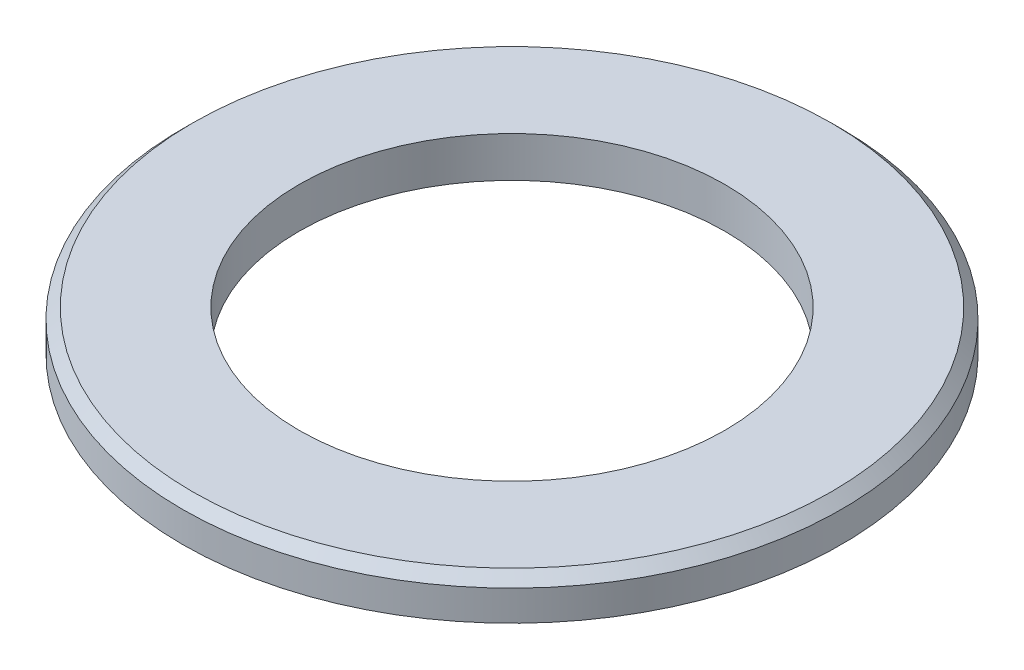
from build123d import *

# Parameters (mm, degrees)
ESQUISSE1_R          = 6.5
ESQUISSE1_R_2        = 4.2
BASE_EXTRUSION_DEPTH = 0.8
CHANFREIN3_SIZE      = 0.2


with BuildPart() as part:
    # Esquisse1 → Base-Extrusion (new body)
    with BuildSketch(Plane(origin=(0, 0, 0), x_dir=(1, 0, 0), z_dir=(0, 1, 0))):
        with Locations(Location((0, 0, 0), (0, 0, 270))):
            Circle(ESQUISSE1_R)
        with Locations(Location((0, 0, 0), (0, 0, 270))):
            Circle(ESQUISSE1_R_2, mode=Mode.SUBTRACT)
    extrude(amount=BASE_EXTRUSION_DEPTH)

    # Chanfrein3
    chanfrein3_edges = [part.edges().sort_by_distance(p)[0] for p in [
        (0, 0.8, -6.5),
    ]]
    chamfer(chanfrein3_edges, length=CHANFREIN3_SIZE)


solid = part.part
